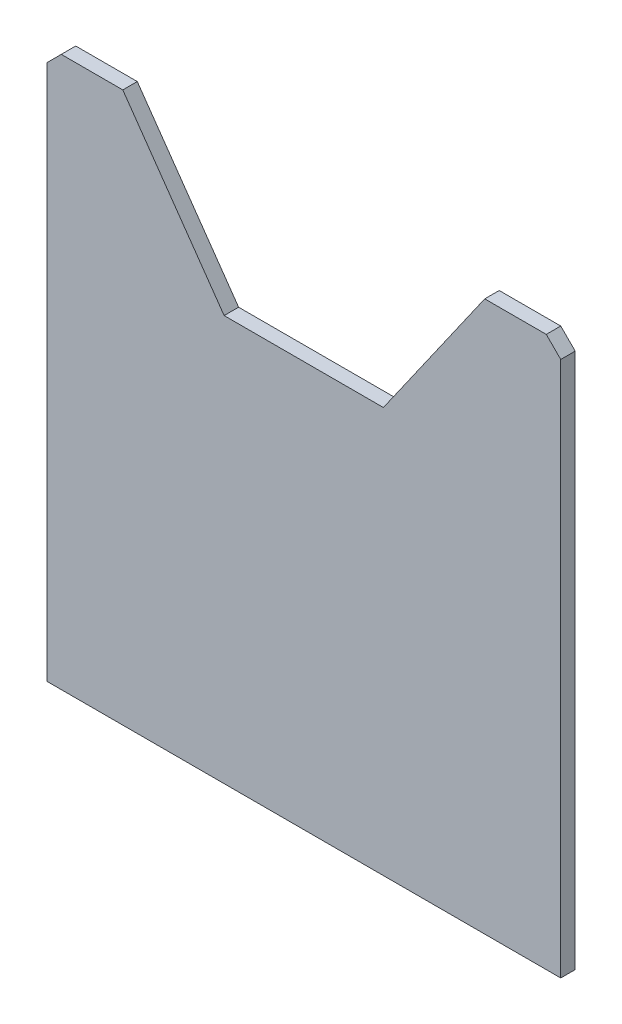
ISO-10303-21;
HEADER;
FILE_DESCRIPTION(('STEP AP214'),'2;1');
FILE_NAME('part.step','',(''),(''),'','','');
FILE_SCHEMA(('AUTOMOTIVE_DESIGN { 1 0 10303 214 1 1 1 1 }'));
ENDSEC;
DATA;
#1=APPLICATION_CONTEXT('core data for automotive mechanical design processes');
#2=APPLICATION_PROTOCOL_DEFINITION('international standard','automotive_design',2000,#1);
#3=PRODUCT_CONTEXT('',#1,'mechanical');
#4=PRODUCT('Part','Part','',(#3));
#5=PRODUCT_RELATED_PRODUCT_CATEGORY('part','',(#4));
#6=PRODUCT_DEFINITION_FORMATION('','',#4);
#7=PRODUCT_DEFINITION_CONTEXT('part definition',#1,'design');
#8=PRODUCT_DEFINITION('design','',#6,#7);
#9=PRODUCT_DEFINITION_SHAPE('','',#8);
#10=(LENGTH_UNIT() NAMED_UNIT(*) SI_UNIT(.MILLI.,.METRE.));
#11=(NAMED_UNIT(*) PLANE_ANGLE_UNIT() SI_UNIT($,.RADIAN.));
#12=(NAMED_UNIT(*) SI_UNIT($,.STERADIAN.) SOLID_ANGLE_UNIT());
#13=UNCERTAINTY_MEASURE_WITH_UNIT(LENGTH_MEASURE(1.E-05),#10,'distance_accuracy_value','');
#14=(GEOMETRIC_REPRESENTATION_CONTEXT(3) GLOBAL_UNCERTAINTY_ASSIGNED_CONTEXT((#13)) GLOBAL_UNIT_ASSIGNED_CONTEXT((#10,
#11,#12)) REPRESENTATION_CONTEXT('',''));
#15=CARTESIAN_POINT('',(0.,0.,0.));
#16=DIRECTION('',(0.,0.,1.));
#17=DIRECTION('',(1.,0.,0.));
#18=AXIS2_PLACEMENT_3D('',#15,#16,#17);
#19=CARTESIAN_POINT('',(0.,0.,10.));
#20=DIRECTION('',(1.,0.,0.));
#21=DIRECTION('',(0.,0.,-1.));
#22=AXIS2_PLACEMENT_3D('',#19,#20,#21);
#23=PLANE('',#22);
#24=DIRECTION('',(0.,-1.,0.));
#25=VECTOR('',#24,1.);
#26=CARTESIAN_POINT('',(0.,0.,0.));
#27=LINE('',#26,#25);
#28=CARTESIAN_POINT('',(0.,370.,0.));
#29=VERTEX_POINT('',#28);
#30=CARTESIAN_POINT('',(0.,0.,0.));
#31=VERTEX_POINT('',#30);
#32=EDGE_CURVE('E139',#29,#31,#27,.T.);
#33=ORIENTED_EDGE('',*,*,#32,.T.);
#34=DIRECTION('',(0.,0.,-1.));
#35=VECTOR('',#34,1.);
#36=CARTESIAN_POINT('',(0.,0.,10.));
#37=LINE('',#36,#35);
#38=CARTESIAN_POINT('',(0.,0.,10.));
#39=VERTEX_POINT('',#38);
#40=EDGE_CURVE('E11',#39,#31,#37,.T.);
#41=ORIENTED_EDGE('',*,*,#40,.F.);
#42=DIRECTION('',(0.,-1.,0.));
#43=VECTOR('',#42,1.);
#44=CARTESIAN_POINT('',(0.,0.,10.));
#45=LINE('',#44,#43);
#46=CARTESIAN_POINT('',(0.,370.,10.));
#47=VERTEX_POINT('',#46);
#48=EDGE_CURVE('E157',#47,#39,#45,.T.);
#49=ORIENTED_EDGE('',*,*,#48,.F.);
#50=DIRECTION('',(0.,0.,-1.));
#51=VECTOR('',#50,1.);
#52=CARTESIAN_POINT('',(0.,370.,10.));
#53=LINE('',#52,#51);
#54=EDGE_CURVE('E135',#47,#29,#53,.T.);
#55=ORIENTED_EDGE('',*,*,#54,.T.);
#56=EDGE_LOOP('',(#33,#41,#49,#55));
#57=FACE_BOUND('',#56,.T.);
#58=ADVANCED_FACE('F31',(#57),#23,.F.);
#59=CARTESIAN_POINT('',(0.,0.,10.));
#60=DIRECTION('',(0.,1.,0.));
#61=DIRECTION('',(-1.,0.,0.));
#62=AXIS2_PLACEMENT_3D('',#59,#60,#61);
#63=PLANE('',#62);
#64=DIRECTION('',(1.,0.,0.));
#65=VECTOR('',#64,1.);
#66=CARTESIAN_POINT('',(0.,0.,0.));
#67=LINE('',#66,#65);
#68=CARTESIAN_POINT('',(355.,0.,0.));
#69=VERTEX_POINT('',#68);
#70=EDGE_CURVE('E142',#31,#69,#67,.T.);
#71=ORIENTED_EDGE('',*,*,#70,.T.);
#72=DIRECTION('',(0.,0.,-1.));
#73=VECTOR('',#72,1.);
#74=CARTESIAN_POINT('',(355.,0.,10.));
#75=LINE('',#74,#73);
#76=CARTESIAN_POINT('',(355.,0.,10.));
#77=VERTEX_POINT('',#76);
#78=EDGE_CURVE('E39',#77,#69,#75,.T.);
#79=ORIENTED_EDGE('',*,*,#78,.F.);
#80=DIRECTION('',(1.,0.,0.));
#81=VECTOR('',#80,1.);
#82=CARTESIAN_POINT('',(0.,0.,10.));
#83=LINE('',#82,#81);
#84=EDGE_CURVE('E96',#39,#77,#83,.T.);
#85=ORIENTED_EDGE('',*,*,#84,.F.);
#86=ORIENTED_EDGE('',*,*,#40,.T.);
#87=EDGE_LOOP('',(#71,#79,#85,#86));
#88=FACE_BOUND('',#87,.T.);
#89=ADVANCED_FACE('F206',(#88),#63,.F.);
#90=CARTESIAN_POINT('',(355.,0.,10.));
#91=DIRECTION('',(-1.,0.,0.));
#92=DIRECTION('',(0.,0.,1.));
#93=AXIS2_PLACEMENT_3D('',#90,#91,#92);
#94=PLANE('',#93);
#95=DIRECTION('',(0.,1.,0.));
#96=VECTOR('',#95,1.);
#97=CARTESIAN_POINT('',(355.,0.,0.));
#98=LINE('',#97,#96);
#99=CARTESIAN_POINT('',(355.,370.,0.));
#100=VERTEX_POINT('',#99);
#101=EDGE_CURVE('E144',#69,#100,#98,.T.);
#102=ORIENTED_EDGE('',*,*,#101,.T.);
#103=DIRECTION('',(0.,0.,-1.));
#104=VECTOR('',#103,1.);
#105=CARTESIAN_POINT('',(355.,370.,10.));
#106=LINE('',#105,#104);
#107=CARTESIAN_POINT('',(355.,370.,10.));
#108=VERTEX_POINT('',#107);
#109=EDGE_CURVE('E170',#108,#100,#106,.T.);
#110=ORIENTED_EDGE('',*,*,#109,.F.);
#111=DIRECTION('',(0.,1.,0.));
#112=VECTOR('',#111,1.);
#113=CARTESIAN_POINT('',(355.,0.,10.));
#114=LINE('',#113,#112);
#115=EDGE_CURVE('E178',#77,#108,#114,.T.);
#116=ORIENTED_EDGE('',*,*,#115,.F.);
#117=ORIENTED_EDGE('',*,*,#78,.T.);
#118=EDGE_LOOP('',(#102,#110,#116,#117));
#119=FACE_BOUND('',#118,.T.);
#120=ADVANCED_FACE('F176',(#119),#94,.F.);
#121=CARTESIAN_POINT('',(355.,370.,10.));
#122=DIRECTION('',(-0.707106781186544,-0.707106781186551,0.));
#123=DIRECTION('',(0.707106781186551,-0.707106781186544,0.));
#124=AXIS2_PLACEMENT_3D('',#121,#122,#123);
#125=PLANE('',#124);
#126=DIRECTION('',(-0.707106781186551,0.707106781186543,0.));
#127=VECTOR('',#126,1.);
#128=CARTESIAN_POINT('',(355.,370.,0.));
#129=LINE('',#128,#127);
#130=CARTESIAN_POINT('',(345.,380.,0.));
#131=VERTEX_POINT('',#130);
#132=EDGE_CURVE('E146',#100,#131,#129,.T.);
#133=ORIENTED_EDGE('',*,*,#132,.T.);
#134=DIRECTION('',(0.,0.,-1.));
#135=VECTOR('',#134,1.);
#136=CARTESIAN_POINT('',(345.,380.,10.));
#137=LINE('',#136,#135);
#138=CARTESIAN_POINT('',(345.,380.,10.));
#139=VERTEX_POINT('',#138);
#140=EDGE_CURVE('E167',#139,#131,#137,.T.);
#141=ORIENTED_EDGE('',*,*,#140,.F.);
#142=DIRECTION('',(-0.707106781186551,0.707106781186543,0.));
#143=VECTOR('',#142,1.);
#144=CARTESIAN_POINT('',(355.,370.,10.));
#145=LINE('',#144,#143);
#146=EDGE_CURVE('E196',#108,#139,#145,.T.);
#147=ORIENTED_EDGE('',*,*,#146,.F.);
#148=ORIENTED_EDGE('',*,*,#109,.T.);
#149=EDGE_LOOP('',(#133,#141,#147,#148));
#150=FACE_BOUND('',#149,.T.);
#151=ADVANCED_FACE('F187',(#150),#125,.F.);
#152=CARTESIAN_POINT('',(302.5,380.,10.));
#153=DIRECTION('',(0.,-1.,0.));
#154=DIRECTION('',(0.,0.,-1.));
#155=AXIS2_PLACEMENT_3D('',#152,#153,#154);
#156=PLANE('',#155);
#157=DIRECTION('',(-1.,0.,0.));
#158=VECTOR('',#157,1.);
#159=CARTESIAN_POINT('',(302.5,380.,0.));
#160=LINE('',#159,#158);
#161=CARTESIAN_POINT('',(302.5,380.,0.));
#162=VERTEX_POINT('',#161);
#163=EDGE_CURVE('E148',#131,#162,#160,.T.);
#164=ORIENTED_EDGE('',*,*,#163,.T.);
#165=DIRECTION('',(0.,0.,-1.));
#166=VECTOR('',#165,1.);
#167=CARTESIAN_POINT('',(302.5,380.,10.));
#168=LINE('',#167,#166);
#169=CARTESIAN_POINT('',(302.5,380.,10.));
#170=VERTEX_POINT('',#169);
#171=EDGE_CURVE('E164',#170,#162,#168,.T.);
#172=ORIENTED_EDGE('',*,*,#171,.F.);
#173=DIRECTION('',(-1.,0.,0.));
#174=VECTOR('',#173,1.);
#175=CARTESIAN_POINT('',(302.5,380.,10.));
#176=LINE('',#175,#174);
#177=EDGE_CURVE('E193',#139,#170,#176,.T.);
#178=ORIENTED_EDGE('',*,*,#177,.F.);
#179=ORIENTED_EDGE('',*,*,#140,.T.);
#180=EDGE_LOOP('',(#164,#172,#178,#179));
#181=FACE_BOUND('',#180,.T.);
#182=ADVANCED_FACE('F191',(#181),#156,.F.);
#183=CARTESIAN_POINT('',(232.5,280.,10.));
#184=DIRECTION('',(0.819231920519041,-0.573462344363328,0.));
#185=DIRECTION('',(0.573462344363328,0.819231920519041,0.));
#186=AXIS2_PLACEMENT_3D('',#183,#184,#185);
#187=PLANE('',#186);
#188=DIRECTION('',(-0.573462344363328,-0.819231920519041,0.));
#189=VECTOR('',#188,1.);
#190=CARTESIAN_POINT('',(232.5,280.,0.));
#191=LINE('',#190,#189);
#192=CARTESIAN_POINT('',(232.5,280.,0.));
#193=VERTEX_POINT('',#192);
#194=EDGE_CURVE('E150',#162,#193,#191,.T.);
#195=ORIENTED_EDGE('',*,*,#194,.T.);
#196=DIRECTION('',(0.,0.,-1.));
#197=VECTOR('',#196,1.);
#198=CARTESIAN_POINT('',(232.5,280.,10.));
#199=LINE('',#198,#197);
#200=CARTESIAN_POINT('',(232.5,280.,10.));
#201=VERTEX_POINT('',#200);
#202=EDGE_CURVE('E161',#201,#193,#199,.T.);
#203=ORIENTED_EDGE('',*,*,#202,.F.);
#204=DIRECTION('',(-0.573462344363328,-0.819231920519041,0.));
#205=VECTOR('',#204,1.);
#206=CARTESIAN_POINT('',(232.5,280.,10.));
#207=LINE('',#206,#205);
#208=EDGE_CURVE('E195',#170,#201,#207,.T.);
#209=ORIENTED_EDGE('',*,*,#208,.F.);
#210=ORIENTED_EDGE('',*,*,#171,.T.);
#211=EDGE_LOOP('',(#195,#203,#209,#210));
#212=FACE_BOUND('',#211,.T.);
#213=ADVANCED_FACE('F218',(#212),#187,.F.);
#214=CARTESIAN_POINT('',(122.5,280.,10.));
#215=DIRECTION('',(0.,-1.,0.));
#216=DIRECTION('',(0.,0.,-1.));
#217=AXIS2_PLACEMENT_3D('',#214,#215,#216);
#218=PLANE('',#217);
#219=DIRECTION('',(-1.,0.,0.));
#220=VECTOR('',#219,1.);
#221=CARTESIAN_POINT('',(122.5,280.,0.));
#222=LINE('',#221,#220);
#223=CARTESIAN_POINT('',(122.5,280.,0.));
#224=VERTEX_POINT('',#223);
#225=EDGE_CURVE('E152',#193,#224,#222,.T.);
#226=ORIENTED_EDGE('',*,*,#225,.T.);
#227=DIRECTION('',(0.,0.,-1.));
#228=VECTOR('',#227,1.);
#229=CARTESIAN_POINT('',(122.5,280.,10.));
#230=LINE('',#229,#228);
#231=CARTESIAN_POINT('',(122.5,280.,10.));
#232=VERTEX_POINT('',#231);
#233=EDGE_CURVE('E130',#232,#224,#230,.T.);
#234=ORIENTED_EDGE('',*,*,#233,.F.);
#235=DIRECTION('',(-1.,0.,0.));
#236=VECTOR('',#235,1.);
#237=CARTESIAN_POINT('',(122.5,280.,10.));
#238=LINE('',#237,#236);
#239=EDGE_CURVE('E121',#201,#232,#238,.T.);
#240=ORIENTED_EDGE('',*,*,#239,.F.);
#241=ORIENTED_EDGE('',*,*,#202,.T.);
#242=EDGE_LOOP('',(#226,#234,#240,#241));
#243=FACE_BOUND('',#242,.T.);
#244=ADVANCED_FACE('F221',(#243),#218,.F.);
#245=CARTESIAN_POINT('',(52.4999999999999,380.,10.));
#246=DIRECTION('',(-0.81923192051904,-0.573462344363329,0.));
#247=DIRECTION('',(0.573462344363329,-0.81923192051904,0.));
#248=AXIS2_PLACEMENT_3D('',#245,#246,#247);
#249=PLANE('',#248);
#250=DIRECTION('',(-0.573462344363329,0.81923192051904,0.));
#251=VECTOR('',#250,1.);
#252=CARTESIAN_POINT('',(52.4999999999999,380.,0.));
#253=LINE('',#252,#251);
#254=CARTESIAN_POINT('',(52.4999999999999,380.,0.));
#255=VERTEX_POINT('',#254);
#256=EDGE_CURVE('E129',#224,#255,#253,.T.);
#257=ORIENTED_EDGE('',*,*,#256,.T.);
#258=DIRECTION('',(0.,0.,-1.));
#259=VECTOR('',#258,1.);
#260=CARTESIAN_POINT('',(52.4999999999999,380.,10.));
#261=LINE('',#260,#259);
#262=CARTESIAN_POINT('',(52.4999999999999,380.,10.));
#263=VERTEX_POINT('',#262);
#264=EDGE_CURVE('E126',#263,#255,#261,.T.);
#265=ORIENTED_EDGE('',*,*,#264,.F.);
#266=DIRECTION('',(-0.573462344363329,0.81923192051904,0.));
#267=VECTOR('',#266,1.);
#268=CARTESIAN_POINT('',(52.4999999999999,380.,10.));
#269=LINE('',#268,#267);
#270=EDGE_CURVE('E115',#232,#263,#269,.T.);
#271=ORIENTED_EDGE('',*,*,#270,.F.);
#272=ORIENTED_EDGE('',*,*,#233,.T.);
#273=EDGE_LOOP('',(#257,#265,#271,#272));
#274=FACE_BOUND('',#273,.T.);
#275=ADVANCED_FACE('F127',(#274),#249,.F.);
#276=CARTESIAN_POINT('',(10.,380.,10.));
#277=DIRECTION('',(0.,-1.,0.));
#278=DIRECTION('',(0.,0.,-1.));
#279=AXIS2_PLACEMENT_3D('',#276,#277,#278);
#280=PLANE('',#279);
#281=DIRECTION('',(-1.,0.,0.));
#282=VECTOR('',#281,1.);
#283=CARTESIAN_POINT('',(10.,380.,0.));
#284=LINE('',#283,#282);
#285=CARTESIAN_POINT('',(10.,380.,0.));
#286=VERTEX_POINT('',#285);
#287=EDGE_CURVE('E82',#255,#286,#284,.T.);
#288=ORIENTED_EDGE('',*,*,#287,.T.);
#289=DIRECTION('',(0.,0.,-1.));
#290=VECTOR('',#289,1.);
#291=CARTESIAN_POINT('',(10.,380.,10.));
#292=LINE('',#291,#290);
#293=CARTESIAN_POINT('',(10.,380.,10.));
#294=VERTEX_POINT('',#293);
#295=EDGE_CURVE('E131',#294,#286,#292,.T.);
#296=ORIENTED_EDGE('',*,*,#295,.F.);
#297=DIRECTION('',(-1.,0.,0.));
#298=VECTOR('',#297,1.);
#299=CARTESIAN_POINT('',(10.,380.,10.));
#300=LINE('',#299,#298);
#301=EDGE_CURVE('E119',#263,#294,#300,.T.);
#302=ORIENTED_EDGE('',*,*,#301,.F.);
#303=ORIENTED_EDGE('',*,*,#264,.T.);
#304=EDGE_LOOP('',(#288,#296,#302,#303));
#305=FACE_BOUND('',#304,.T.);
#306=ADVANCED_FACE('F133',(#305),#280,.F.);
#307=CARTESIAN_POINT('',(0.,370.,10.));
#308=DIRECTION('',(0.707106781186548,-0.707106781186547,0.));
#309=DIRECTION('',(0.707106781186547,0.707106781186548,0.));
#310=AXIS2_PLACEMENT_3D('',#307,#308,#309);
#311=PLANE('',#310);
#312=DIRECTION('',(-0.707106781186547,-0.707106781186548,0.));
#313=VECTOR('',#312,1.);
#314=CARTESIAN_POINT('',(0.,370.,0.));
#315=LINE('',#314,#313);
#316=EDGE_CURVE('E88',#286,#29,#315,.T.);
#317=ORIENTED_EDGE('',*,*,#316,.T.);
#318=ORIENTED_EDGE('',*,*,#54,.F.);
#319=DIRECTION('',(-0.707106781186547,-0.707106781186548,0.));
#320=VECTOR('',#319,1.);
#321=CARTESIAN_POINT('',(0.,370.,10.));
#322=LINE('',#321,#320);
#323=EDGE_CURVE('E47',#294,#47,#322,.T.);
#324=ORIENTED_EDGE('',*,*,#323,.F.);
#325=ORIENTED_EDGE('',*,*,#295,.T.);
#326=EDGE_LOOP('',(#317,#318,#324,#325));
#327=FACE_BOUND('',#326,.T.);
#328=ADVANCED_FACE('F230',(#327),#311,.F.);
#329=CARTESIAN_POINT('',(0.,380.,10.));
#330=DIRECTION('',(0.,0.,-1.));
#331=DIRECTION('',(-1.,0.,0.));
#332=AXIS2_PLACEMENT_3D('',#329,#330,#331);
#333=PLANE('',#332);
#334=ORIENTED_EDGE('',*,*,#48,.T.);
#335=ORIENTED_EDGE('',*,*,#84,.T.);
#336=ORIENTED_EDGE('',*,*,#115,.T.);
#337=ORIENTED_EDGE('',*,*,#146,.T.);
#338=ORIENTED_EDGE('',*,*,#177,.T.);
#339=ORIENTED_EDGE('',*,*,#208,.T.);
#340=ORIENTED_EDGE('',*,*,#239,.T.);
#341=ORIENTED_EDGE('',*,*,#270,.T.);
#342=ORIENTED_EDGE('',*,*,#301,.T.);
#343=ORIENTED_EDGE('',*,*,#323,.T.);
#344=EDGE_LOOP('',(#334,#335,#336,#337,#338,#339,#340,#341,#342,#343));
#345=FACE_BOUND('',#344,.T.);
#346=ADVANCED_FACE('F117',(#345),#333,.F.);
#347=CARTESIAN_POINT('',(0.,380.,0.));
#348=DIRECTION('',(0.,0.,-1.));
#349=DIRECTION('',(-1.,0.,0.));
#350=AXIS2_PLACEMENT_3D('',#347,#348,#349);
#351=PLANE('',#350);
#352=ORIENTED_EDGE('',*,*,#32,.F.);
#353=ORIENTED_EDGE('',*,*,#316,.F.);
#354=ORIENTED_EDGE('',*,*,#287,.F.);
#355=ORIENTED_EDGE('',*,*,#256,.F.);
#356=ORIENTED_EDGE('',*,*,#225,.F.);
#357=ORIENTED_EDGE('',*,*,#194,.F.);
#358=ORIENTED_EDGE('',*,*,#163,.F.);
#359=ORIENTED_EDGE('',*,*,#132,.F.);
#360=ORIENTED_EDGE('',*,*,#101,.F.);
#361=ORIENTED_EDGE('',*,*,#70,.F.);
#362=EDGE_LOOP('',(#352,#353,#354,#355,#356,#357,#358,#359,#360,#361));
#363=FACE_BOUND('',#362,.T.);
#364=ADVANCED_FACE('F182',(#363),#351,.T.);
#365=CLOSED_SHELL('',(#58,#89,#120,#151,#182,#213,#244,#275,#306,#328,#346,#364));
#366=MANIFOLD_SOLID_BREP('B2',#365);
#367=ADVANCED_BREP_SHAPE_REPRESENTATION('',(#18,#366),#14);
#368=SHAPE_DEFINITION_REPRESENTATION(#9,#367);
ENDSEC;
END-ISO-10303-21;
